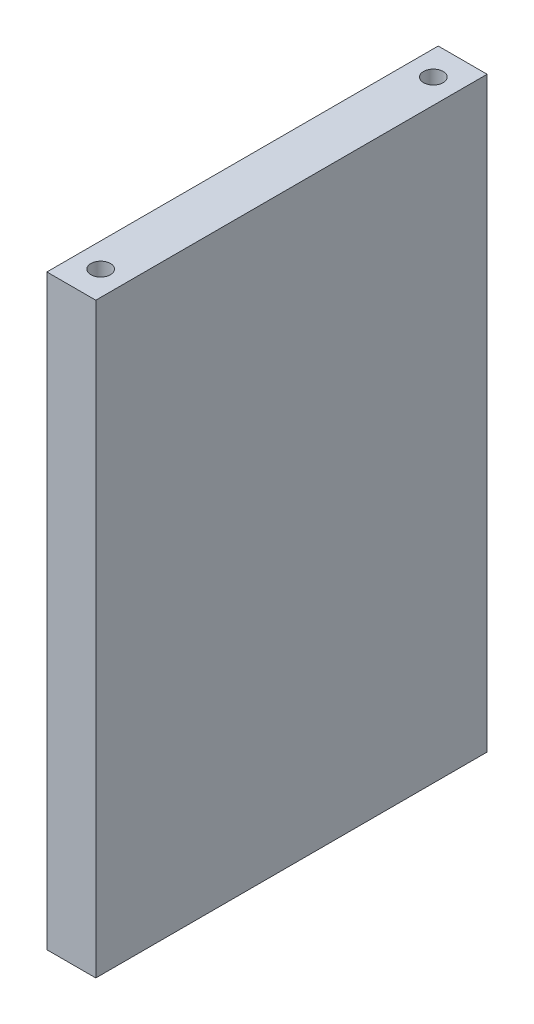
ISO-10303-21;
HEADER;
FILE_DESCRIPTION(('STEP AP214'),'2;1');
FILE_NAME('part.step','',(''),(''),'','','');
FILE_SCHEMA(('AUTOMOTIVE_DESIGN { 1 0 10303 214 1 1 1 1 }'));
ENDSEC;
DATA;
#1=APPLICATION_CONTEXT('core data for automotive mechanical design processes');
#2=APPLICATION_PROTOCOL_DEFINITION('international standard','automotive_design',2000,#1);
#3=PRODUCT_CONTEXT('',#1,'mechanical');
#4=PRODUCT('Part','Part','',(#3));
#5=PRODUCT_RELATED_PRODUCT_CATEGORY('part','',(#4));
#6=PRODUCT_DEFINITION_FORMATION('','',#4);
#7=PRODUCT_DEFINITION_CONTEXT('part definition',#1,'design');
#8=PRODUCT_DEFINITION('design','',#6,#7);
#9=PRODUCT_DEFINITION_SHAPE('','',#8);
#10=(LENGTH_UNIT() NAMED_UNIT(*) SI_UNIT(.MILLI.,.METRE.));
#11=(NAMED_UNIT(*) PLANE_ANGLE_UNIT() SI_UNIT($,.RADIAN.));
#12=(NAMED_UNIT(*) SI_UNIT($,.STERADIAN.) SOLID_ANGLE_UNIT());
#13=UNCERTAINTY_MEASURE_WITH_UNIT(LENGTH_MEASURE(1.E-05),#10,'distance_accuracy_value','');
#14=(GEOMETRIC_REPRESENTATION_CONTEXT(3) GLOBAL_UNCERTAINTY_ASSIGNED_CONTEXT((#13)) GLOBAL_UNIT_ASSIGNED_CONTEXT((#10,
#11,#12)) REPRESENTATION_CONTEXT('',''));
#15=CARTESIAN_POINT('',(0.,0.,0.));
#16=DIRECTION('',(0.,0.,1.));
#17=DIRECTION('',(1.,0.,0.));
#18=AXIS2_PLACEMENT_3D('',#15,#16,#17);
#19=CARTESIAN_POINT('',(0.,0.,-80.));
#20=DIRECTION('',(-1.,0.,0.));
#21=DIRECTION('',(0.,0.,1.));
#22=AXIS2_PLACEMENT_3D('',#19,#20,#21);
#23=PLANE('',#22);
#24=DIRECTION('',(0.,-1.,0.));
#25=VECTOR('',#24,1.);
#26=CARTESIAN_POINT('',(0.,0.,0.));
#27=LINE('',#26,#25);
#28=CARTESIAN_POINT('',(0.,120.,0.));
#29=VERTEX_POINT('',#28);
#30=CARTESIAN_POINT('',(0.,0.,0.));
#31=VERTEX_POINT('',#30);
#32=EDGE_CURVE('E67',#29,#31,#27,.T.);
#33=ORIENTED_EDGE('',*,*,#32,.F.);
#34=DIRECTION('',(0.,0.,1.));
#35=VECTOR('',#34,1.);
#36=CARTESIAN_POINT('',(0.,120.,-80.));
#37=LINE('',#36,#35);
#38=CARTESIAN_POINT('',(0.,120.,-80.));
#39=VERTEX_POINT('',#38);
#40=EDGE_CURVE('E11',#39,#29,#37,.T.);
#41=ORIENTED_EDGE('',*,*,#40,.F.);
#42=DIRECTION('',(0.,-1.,0.));
#43=VECTOR('',#42,1.);
#44=CARTESIAN_POINT('',(0.,0.,-80.));
#45=LINE('',#44,#43);
#46=CARTESIAN_POINT('',(0.,0.,-80.));
#47=VERTEX_POINT('',#46);
#48=EDGE_CURVE('E69',#39,#47,#45,.T.);
#49=ORIENTED_EDGE('',*,*,#48,.T.);
#50=DIRECTION('',(0.,0.,1.));
#51=VECTOR('',#50,1.);
#52=CARTESIAN_POINT('',(0.,0.,-80.));
#53=LINE('',#52,#51);
#54=EDGE_CURVE('E30',#47,#31,#53,.T.);
#55=ORIENTED_EDGE('',*,*,#54,.T.);
#56=EDGE_LOOP('',(#33,#41,#49,#55));
#57=FACE_BOUND('',#56,.T.);
#58=ADVANCED_FACE('F27',(#57),#23,.T.);
#59=CARTESIAN_POINT('',(0.,120.,-80.));
#60=DIRECTION('',(0.,1.,0.));
#61=DIRECTION('',(0.,0.,1.));
#62=AXIS2_PLACEMENT_3D('',#59,#60,#61);
#63=PLANE('',#62);
#64=CARTESIAN_POINT('',(5.,120.,-5.99999999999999));
#65=DIRECTION('',(0.,1.,0.));
#66=DIRECTION('',(0.,0.,1.));
#67=AXIS2_PLACEMENT_3D('',#64,#65,#66);
#68=CIRCLE('',#67,2.);
#69=CARTESIAN_POINT('',(5.,120.,-3.99999999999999));
#70=VERTEX_POINT('',#69);
#71=EDGE_CURVE('E130',#70,#70,#68,.T.);
#72=ORIENTED_EDGE('',*,*,#71,.F.);
#73=EDGE_LOOP('',(#72));
#74=FACE_BOUND('',#73,.T.);
#75=CARTESIAN_POINT('',(5.,120.,-74.));
#76=DIRECTION('',(0.,1.,0.));
#77=DIRECTION('',(0.,0.,1.));
#78=AXIS2_PLACEMENT_3D('',#75,#76,#77);
#79=CIRCLE('',#78,2.);
#80=CARTESIAN_POINT('',(5.,120.,-72.));
#81=VERTEX_POINT('',#80);
#82=EDGE_CURVE('E88',#81,#81,#79,.T.);
#83=ORIENTED_EDGE('',*,*,#82,.F.);
#84=EDGE_LOOP('',(#83));
#85=FACE_BOUND('',#84,.T.);
#86=DIRECTION('',(-1.,0.,0.));
#87=VECTOR('',#86,1.);
#88=CARTESIAN_POINT('',(0.,120.,0.));
#89=LINE('',#88,#87);
#90=CARTESIAN_POINT('',(10.,120.,0.));
#91=VERTEX_POINT('',#90);
#92=EDGE_CURVE('E84',#91,#29,#89,.T.);
#93=ORIENTED_EDGE('',*,*,#92,.F.);
#94=DIRECTION('',(0.,0.,1.));
#95=VECTOR('',#94,1.);
#96=CARTESIAN_POINT('',(10.,120.,-80.));
#97=LINE('',#96,#95);
#98=CARTESIAN_POINT('',(10.,120.,-80.));
#99=VERTEX_POINT('',#98);
#100=EDGE_CURVE('E35',#99,#91,#97,.T.);
#101=ORIENTED_EDGE('',*,*,#100,.F.);
#102=DIRECTION('',(-1.,0.,0.));
#103=VECTOR('',#102,1.);
#104=CARTESIAN_POINT('',(0.,120.,-80.));
#105=LINE('',#104,#103);
#106=EDGE_CURVE('E74',#99,#39,#105,.T.);
#107=ORIENTED_EDGE('',*,*,#106,.T.);
#108=ORIENTED_EDGE('',*,*,#40,.T.);
#109=EDGE_LOOP('',(#93,#101,#107,#108));
#110=FACE_BOUND('',#109,.T.);
#111=ADVANCED_FACE('F104',(#74,#85,#110),#63,.T.);
#112=CARTESIAN_POINT('',(10.,0.,-80.));
#113=DIRECTION('',(1.,0.,0.));
#114=DIRECTION('',(0.,0.,-1.));
#115=AXIS2_PLACEMENT_3D('',#112,#113,#114);
#116=PLANE('',#115);
#117=DIRECTION('',(0.,1.,0.));
#118=VECTOR('',#117,1.);
#119=CARTESIAN_POINT('',(10.,0.,0.));
#120=LINE('',#119,#118);
#121=CARTESIAN_POINT('',(10.,0.,0.));
#122=VERTEX_POINT('',#121);
#123=EDGE_CURVE('E81',#122,#91,#120,.T.);
#124=ORIENTED_EDGE('',*,*,#123,.F.);
#125=DIRECTION('',(0.,0.,1.));
#126=VECTOR('',#125,1.);
#127=CARTESIAN_POINT('',(10.,0.,-80.));
#128=LINE('',#127,#126);
#129=CARTESIAN_POINT('',(10.,0.,-80.));
#130=VERTEX_POINT('',#129);
#131=EDGE_CURVE('E73',#130,#122,#128,.T.);
#132=ORIENTED_EDGE('',*,*,#131,.F.);
#133=DIRECTION('',(0.,1.,0.));
#134=VECTOR('',#133,1.);
#135=CARTESIAN_POINT('',(10.,0.,-80.));
#136=LINE('',#135,#134);
#137=EDGE_CURVE('E97',#130,#99,#136,.T.);
#138=ORIENTED_EDGE('',*,*,#137,.T.);
#139=ORIENTED_EDGE('',*,*,#100,.T.);
#140=EDGE_LOOP('',(#124,#132,#138,#139));
#141=FACE_BOUND('',#140,.T.);
#142=ADVANCED_FACE('F101',(#141),#116,.T.);
#143=CARTESIAN_POINT('',(0.,0.,-80.));
#144=DIRECTION('',(0.,-1.,0.));
#145=DIRECTION('',(0.,0.,-1.));
#146=AXIS2_PLACEMENT_3D('',#143,#144,#145);
#147=PLANE('',#146);
#148=CARTESIAN_POINT('',(4.97443290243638,0.,-5.99999999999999));
#149=DIRECTION('',(0.,-1.,0.));
#150=DIRECTION('',(0.,0.,-1.));
#151=AXIS2_PLACEMENT_3D('',#148,#149,#150);
#152=CIRCLE('',#151,2.);
#153=CARTESIAN_POINT('',(4.97443290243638,0.,-7.99999999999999));
#154=VERTEX_POINT('',#153);
#155=EDGE_CURVE('E148',#154,#154,#152,.T.);
#156=ORIENTED_EDGE('',*,*,#155,.F.);
#157=EDGE_LOOP('',(#156));
#158=FACE_BOUND('',#157,.T.);
#159=CARTESIAN_POINT('',(4.97443290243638,0.,-74.));
#160=DIRECTION('',(0.,-1.,0.));
#161=DIRECTION('',(0.,0.,-1.));
#162=AXIS2_PLACEMENT_3D('',#159,#160,#161);
#163=CIRCLE('',#162,2.);
#164=CARTESIAN_POINT('',(4.97443290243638,0.,-76.));
#165=VERTEX_POINT('',#164);
#166=EDGE_CURVE('E142',#165,#165,#163,.T.);
#167=ORIENTED_EDGE('',*,*,#166,.F.);
#168=EDGE_LOOP('',(#167));
#169=FACE_BOUND('',#168,.T.);
#170=DIRECTION('',(1.,0.,0.));
#171=VECTOR('',#170,1.);
#172=CARTESIAN_POINT('',(0.,0.,0.));
#173=LINE('',#172,#171);
#174=EDGE_CURVE('E76',#31,#122,#173,.T.);
#175=ORIENTED_EDGE('',*,*,#174,.F.);
#176=ORIENTED_EDGE('',*,*,#54,.F.);
#177=DIRECTION('',(1.,0.,0.));
#178=VECTOR('',#177,1.);
#179=CARTESIAN_POINT('',(0.,0.,-80.));
#180=LINE('',#179,#178);
#181=EDGE_CURVE('E95',#47,#130,#180,.T.);
#182=ORIENTED_EDGE('',*,*,#181,.T.);
#183=ORIENTED_EDGE('',*,*,#131,.T.);
#184=EDGE_LOOP('',(#175,#176,#182,#183));
#185=FACE_BOUND('',#184,.T.);
#186=ADVANCED_FACE('F77',(#158,#169,#185),#147,.T.);
#187=CARTESIAN_POINT('',(0.,120.,-80.));
#188=DIRECTION('',(0.,0.,-1.));
#189=DIRECTION('',(-1.,0.,0.));
#190=AXIS2_PLACEMENT_3D('',#187,#188,#189);
#191=PLANE('',#190);
#192=ORIENTED_EDGE('',*,*,#48,.F.);
#193=ORIENTED_EDGE('',*,*,#106,.F.);
#194=ORIENTED_EDGE('',*,*,#137,.F.);
#195=ORIENTED_EDGE('',*,*,#181,.F.);
#196=EDGE_LOOP('',(#192,#193,#194,#195));
#197=FACE_BOUND('',#196,.T.);
#198=ADVANCED_FACE('F106',(#197),#191,.T.);
#199=CARTESIAN_POINT('',(0.,120.,0.));
#200=DIRECTION('',(0.,0.,-1.));
#201=DIRECTION('',(-1.,0.,0.));
#202=AXIS2_PLACEMENT_3D('',#199,#200,#201);
#203=PLANE('',#202);
#204=ORIENTED_EDGE('',*,*,#32,.T.);
#205=ORIENTED_EDGE('',*,*,#174,.T.);
#206=ORIENTED_EDGE('',*,*,#123,.T.);
#207=ORIENTED_EDGE('',*,*,#92,.T.);
#208=EDGE_LOOP('',(#204,#205,#206,#207));
#209=FACE_BOUND('',#208,.T.);
#210=ADVANCED_FACE('F83',(#209),#203,.F.);
#211=CARTESIAN_POINT('',(5.,110.,-74.));
#212=DIRECTION('',(0.,1.,0.));
#213=DIRECTION('',(0.,0.,1.));
#214=AXIS2_PLACEMENT_3D('',#211,#212,#213);
#215=CYLINDRICAL_SURFACE('',#214,2.);
#216=CARTESIAN_POINT('',(5.,110.,-74.));
#217=DIRECTION('',(0.,1.,0.));
#218=DIRECTION('',(0.,0.,1.));
#219=AXIS2_PLACEMENT_3D('',#216,#217,#218);
#220=CIRCLE('',#219,2.);
#221=CARTESIAN_POINT('',(5.,110.,-72.));
#222=VERTEX_POINT('',#221);
#223=EDGE_CURVE('E85',#222,#222,#220,.T.);
#224=ORIENTED_EDGE('',*,*,#223,.F.);
#225=EDGE_LOOP('',(#224));
#226=FACE_BOUND('',#225,.T.);
#227=ORIENTED_EDGE('',*,*,#82,.T.);
#228=EDGE_LOOP('',(#227));
#229=FACE_BOUND('',#228,.T.);
#230=ADVANCED_FACE('F113',(#226,#229),#215,.F.);
#231=CARTESIAN_POINT('',(5.,110.,-74.));
#232=DIRECTION('',(0.,1.,0.));
#233=DIRECTION('',(0.,0.,1.));
#234=AXIS2_PLACEMENT_3D('',#231,#232,#233);
#235=PLANE('',#234);
#236=ORIENTED_EDGE('',*,*,#223,.T.);
#237=EDGE_LOOP('',(#236));
#238=FACE_BOUND('',#237,.T.);
#239=ADVANCED_FACE('F176',(#238),#235,.T.);
#240=CARTESIAN_POINT('',(5.,110.,-5.99999999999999));
#241=DIRECTION('',(0.,1.,0.));
#242=DIRECTION('',(0.,0.,1.));
#243=AXIS2_PLACEMENT_3D('',#240,#241,#242);
#244=CYLINDRICAL_SURFACE('',#243,2.);
#245=CARTESIAN_POINT('',(5.,110.,-5.99999999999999));
#246=DIRECTION('',(0.,1.,0.));
#247=DIRECTION('',(0.,0.,1.));
#248=AXIS2_PLACEMENT_3D('',#245,#246,#247);
#249=CIRCLE('',#248,2.);
#250=CARTESIAN_POINT('',(5.,110.,-3.99999999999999));
#251=VERTEX_POINT('',#250);
#252=EDGE_CURVE('E134',#251,#251,#249,.T.);
#253=ORIENTED_EDGE('',*,*,#252,.F.);
#254=EDGE_LOOP('',(#253));
#255=FACE_BOUND('',#254,.T.);
#256=ORIENTED_EDGE('',*,*,#71,.T.);
#257=EDGE_LOOP('',(#256));
#258=FACE_BOUND('',#257,.T.);
#259=ADVANCED_FACE('F168',(#255,#258),#244,.F.);
#260=CARTESIAN_POINT('',(5.,110.,-5.99999999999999));
#261=DIRECTION('',(0.,1.,0.));
#262=DIRECTION('',(0.,0.,1.));
#263=AXIS2_PLACEMENT_3D('',#260,#261,#262);
#264=PLANE('',#263);
#265=ORIENTED_EDGE('',*,*,#252,.T.);
#266=EDGE_LOOP('',(#265));
#267=FACE_BOUND('',#266,.T.);
#268=ADVANCED_FACE('F159',(#267),#264,.T.);
#269=CARTESIAN_POINT('',(4.97443290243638,10.,-74.));
#270=DIRECTION('',(0.,-1.,0.));
#271=DIRECTION('',(0.,0.,-1.));
#272=AXIS2_PLACEMENT_3D('',#269,#270,#271);
#273=CYLINDRICAL_SURFACE('',#272,2.);
#274=CARTESIAN_POINT('',(4.97443290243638,10.,-74.));
#275=DIRECTION('',(0.,-1.,0.));
#276=DIRECTION('',(0.,0.,-1.));
#277=AXIS2_PLACEMENT_3D('',#274,#275,#276);
#278=CIRCLE('',#277,2.);
#279=CARTESIAN_POINT('',(4.97443290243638,10.,-76.));
#280=VERTEX_POINT('',#279);
#281=EDGE_CURVE('E139',#280,#280,#278,.T.);
#282=ORIENTED_EDGE('',*,*,#281,.F.);
#283=EDGE_LOOP('',(#282));
#284=FACE_BOUND('',#283,.T.);
#285=ORIENTED_EDGE('',*,*,#166,.T.);
#286=EDGE_LOOP('',(#285));
#287=FACE_BOUND('',#286,.T.);
#288=ADVANCED_FACE('F156',(#284,#287),#273,.F.);
#289=CARTESIAN_POINT('',(4.97443290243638,10.,-74.));
#290=DIRECTION('',(0.,-1.,0.));
#291=DIRECTION('',(0.,0.,-1.));
#292=AXIS2_PLACEMENT_3D('',#289,#290,#291);
#293=PLANE('',#292);
#294=ORIENTED_EDGE('',*,*,#281,.T.);
#295=EDGE_LOOP('',(#294));
#296=FACE_BOUND('',#295,.T.);
#297=ADVANCED_FACE('F158',(#296),#293,.T.);
#298=CARTESIAN_POINT('',(4.97443290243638,10.,-5.99999999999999));
#299=DIRECTION('',(0.,-1.,0.));
#300=DIRECTION('',(0.,0.,-1.));
#301=AXIS2_PLACEMENT_3D('',#298,#299,#300);
#302=CYLINDRICAL_SURFACE('',#301,2.);
#303=CARTESIAN_POINT('',(4.97443290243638,10.,-5.99999999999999));
#304=DIRECTION('',(0.,-1.,0.));
#305=DIRECTION('',(0.,0.,-1.));
#306=AXIS2_PLACEMENT_3D('',#303,#304,#305);
#307=CIRCLE('',#306,2.);
#308=CARTESIAN_POINT('',(4.97443290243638,10.,-7.99999999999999));
#309=VERTEX_POINT('',#308);
#310=EDGE_CURVE('E145',#309,#309,#307,.T.);
#311=ORIENTED_EDGE('',*,*,#310,.F.);
#312=EDGE_LOOP('',(#311));
#313=FACE_BOUND('',#312,.T.);
#314=ORIENTED_EDGE('',*,*,#155,.T.);
#315=EDGE_LOOP('',(#314));
#316=FACE_BOUND('',#315,.T.);
#317=ADVANCED_FACE('F152',(#313,#316),#302,.F.);
#318=CARTESIAN_POINT('',(4.97443290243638,10.,-5.99999999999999));
#319=DIRECTION('',(0.,-1.,0.));
#320=DIRECTION('',(0.,0.,-1.));
#321=AXIS2_PLACEMENT_3D('',#318,#319,#320);
#322=PLANE('',#321);
#323=ORIENTED_EDGE('',*,*,#310,.T.);
#324=EDGE_LOOP('',(#323));
#325=FACE_BOUND('',#324,.T.);
#326=ADVANCED_FACE('F228',(#325),#322,.T.);
#327=CLOSED_SHELL('',(#58,#111,#142,#186,#198,#210,#230,#239,#259,#268,#288,#297,#317,#326));
#328=MANIFOLD_SOLID_BREP('B2',#327);
#329=ADVANCED_BREP_SHAPE_REPRESENTATION('',(#18,#328),#14);
#330=SHAPE_DEFINITION_REPRESENTATION(#9,#329);
ENDSEC;
END-ISO-10303-21;
